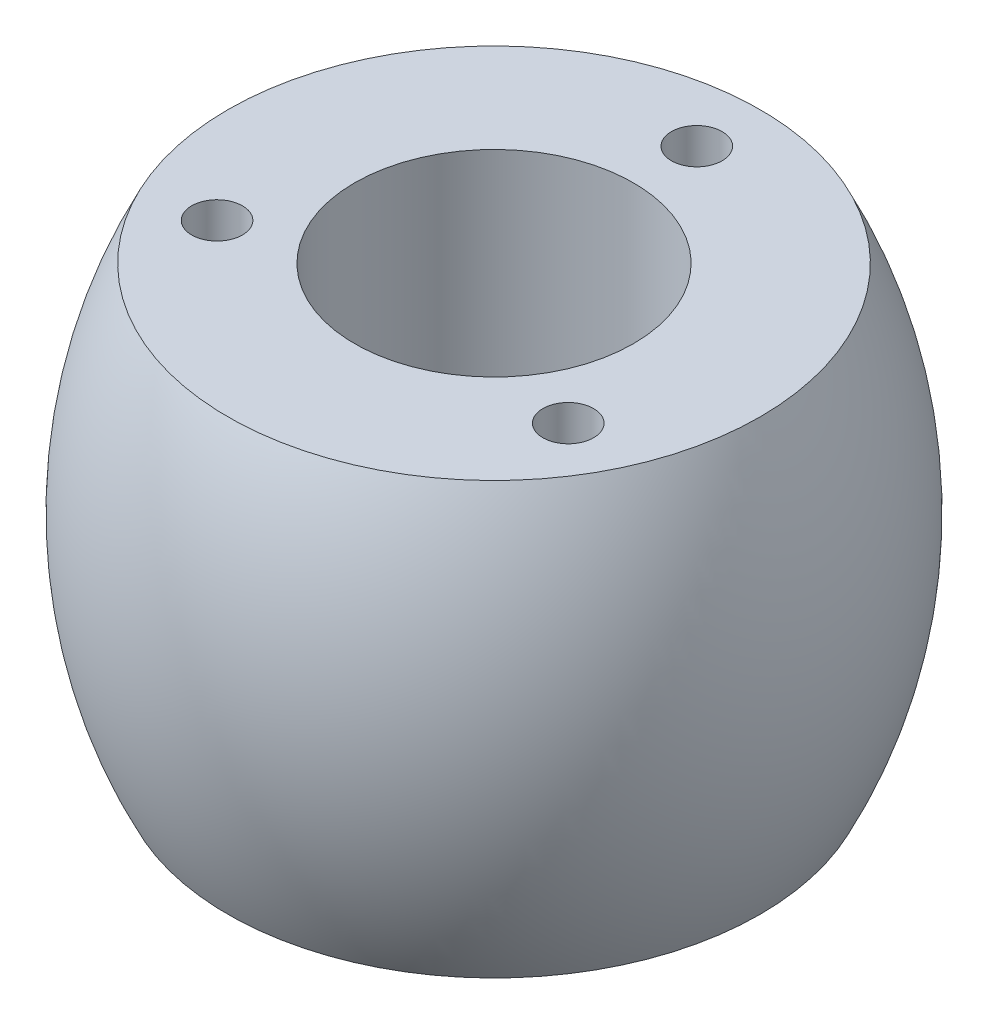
from build123d import *

# Parameters (mm, degrees)
ESQUISSE2_R                  = 11
ENL_V_MAT_EXTRU_1_DEPTH      = 50.050994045
ESQUISSE3_R                  = 2
ENL_V_MAT_EXTRU_2_DEPTH      = 8
R_P_TITION_CIRCULAIRE1_COUNT = 3
ENL_V_START                  = -8
ESQUISSE4_R                  = 2
ENL_V_MAT_EXTRU_3_DEPTH      = 8
R_P_TITION_CIRCULAIRE2_COUNT = 3


with BuildPart() as part:
    # Esquisse1 → R_volution1 (revolve)
    with BuildSketch(Plane.XY, mode=Mode.PRIVATE) as r_volution1_sk:
        with BuildLine():
            Line((0, 0), (21, 0))
            ThreePointArc((21, 0), (25, 17), (21, 34))
            Line((21, 34), (0, 34))
            Line((0, 34), (0, 0))
        make_face()
    revolve(r_volution1_sk.sketch.rotate(Axis((0, 34, 0), (0, -1, 0)), 180), axis=Axis((0, 34, 0), (0, -1, 0)))

    # Esquisse2 → Enl_v. mat.-Extru.1 (cut, through all)
    with BuildSketch(Plane(origin=(0, 34, 0), x_dir=(1, 0, 0), z_dir=(0, 1, 0))):
        with Locations(Location((0, 0, 0), (0, 0, 180))):
            Circle(ESQUISSE2_R)
    extrude(amount=-ENL_V_MAT_EXTRU_1_DEPTH, mode=Mode.SUBTRACT)

    # Esquisse3 → Enl_v. mat.-Extru.2 (cut)
    with BuildSketch(Plane(origin=(0, 34, 0), x_dir=(1, 0, 0), z_dir=(0, 1, 0))):
        with Locations(Location((0, 16, 0), (0, 0, 180))):
            Circle(ESQUISSE3_R)
    enl_v_mat_extru_2 = extrude(amount=-ENL_V_MAT_EXTRU_2_DEPTH, mode=Mode.SUBTRACT)

    # R_p_tition circulaire1: Enl_v. mat.-Extru.2 ×3 about axis
    r_p_tition_circulaire1_axis = Axis((0, 0, 0), (0, 1, 0))
    for i in range(1, R_P_TITION_CIRCULAIRE1_COUNT):
        add(enl_v_mat_extru_2.rotate(r_p_tition_circulaire1_axis, i * 360 / R_P_TITION_CIRCULAIRE1_COUNT), mode=Mode.SUBTRACT)

    # Esquisse4 → Enl_v. mat.-Extru.3 (cut)
    with BuildSketch(Plane.XZ.offset(ENL_V_START)):
        with Locations(Location((0, -16, 0), (0, 0, 180))):
            Circle(ESQUISSE4_R)
    enl_v_mat_extru_3 = extrude(amount=ENL_V_MAT_EXTRU_3_DEPTH, mode=Mode.SUBTRACT)

    # R_p_tition circulaire2: Enl_v. mat.-Extru.3 ×3 about axis
    r_p_tition_circulaire2_axis = Axis((0, 0, 0), (0, 1, 0))
    for i in range(1, R_P_TITION_CIRCULAIRE2_COUNT):
        add(enl_v_mat_extru_3.rotate(r_p_tition_circulaire2_axis, i * 360 / R_P_TITION_CIRCULAIRE2_COUNT), mode=Mode.SUBTRACT)


solid = part.part
